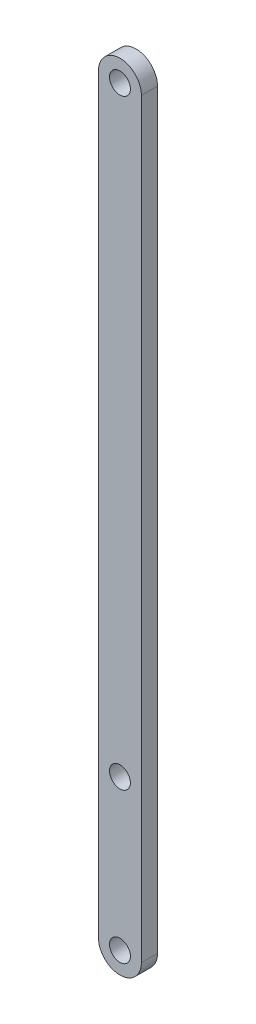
from build123d import *

# Parameters (mm, degrees)
EXTRUDE_1_DEPTH         = 3
HOLE_WIZARD_3_9_3_9_1_D = 3.9
HOLE_WIZARD_3_9_3_9_2_D = 3.9


with BuildPart() as part:
    # Sketch 1 → Extrude 1 (new body)
    with BuildSketch(Plane.XY):
        with BuildLine():
            Line((-4, 0), (-4, 140))
            ThreePointArc((-4, 140), (0, 144), (4, 140))
            Line((4, 140), (4, 0))
            ThreePointArc((4, 0), (0, -4), (-4, 0))
        make_face()
    extrude(amount=EXTRUDE_1_DEPTH)

    # Hole Wizard 3.9 _3.9_ _1 (through all)
    with Locations(Plane.XY.offset(3)):
        with Locations((0, 140), (0, 0)):
            Hole(HOLE_WIZARD_3_9_3_9_1_D / 2)

    # Hole Wizard 3.9 _3.9_ _2 (through all)
    with Locations(Plane.XY.offset(3)):
        with Locations((0, 28)):
            Hole(HOLE_WIZARD_3_9_3_9_2_D / 2)


solid = part.part
